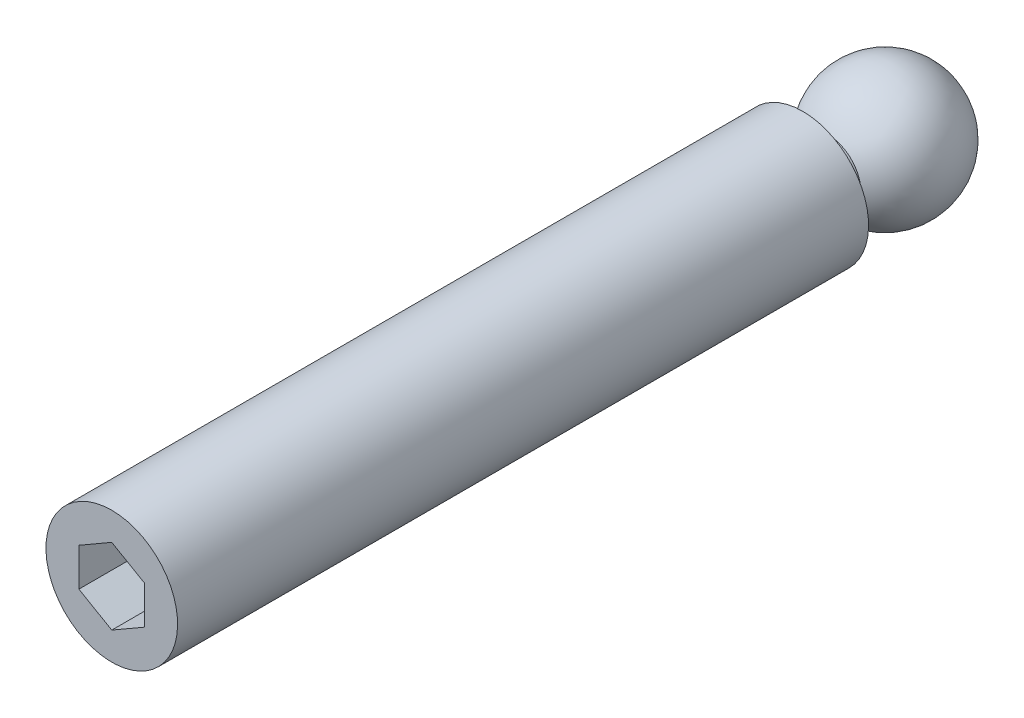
ISO-10303-21;
HEADER;
FILE_DESCRIPTION(('STEP AP214'),'2;1');
FILE_NAME('part.step','',(''),(''),'','','');
FILE_SCHEMA(('AUTOMOTIVE_DESIGN { 1 0 10303 214 1 1 1 1 }'));
ENDSEC;
DATA;
#1=APPLICATION_CONTEXT('core data for automotive mechanical design processes');
#2=APPLICATION_PROTOCOL_DEFINITION('international standard','automotive_design',2000,#1);
#3=PRODUCT_CONTEXT('',#1,'mechanical');
#4=PRODUCT('Part','Part','',(#3));
#5=PRODUCT_RELATED_PRODUCT_CATEGORY('part','',(#4));
#6=PRODUCT_DEFINITION_FORMATION('','',#4);
#7=PRODUCT_DEFINITION_CONTEXT('part definition',#1,'design');
#8=PRODUCT_DEFINITION('design','',#6,#7);
#9=PRODUCT_DEFINITION_SHAPE('','',#8);
#10=(LENGTH_UNIT() NAMED_UNIT(*) SI_UNIT(.MILLI.,.METRE.));
#11=(NAMED_UNIT(*) PLANE_ANGLE_UNIT() SI_UNIT($,.RADIAN.));
#12=(NAMED_UNIT(*) SI_UNIT($,.STERADIAN.) SOLID_ANGLE_UNIT());
#13=UNCERTAINTY_MEASURE_WITH_UNIT(LENGTH_MEASURE(1.E-05),#10,'distance_accuracy_value','');
#14=(GEOMETRIC_REPRESENTATION_CONTEXT(3) GLOBAL_UNCERTAINTY_ASSIGNED_CONTEXT((#13)) GLOBAL_UNIT_ASSIGNED_CONTEXT((#10,
#11,#12)) REPRESENTATION_CONTEXT('',''));
#15=CARTESIAN_POINT('',(0.,0.,0.));
#16=DIRECTION('',(0.,0.,1.));
#17=DIRECTION('',(1.,0.,0.));
#18=AXIS2_PLACEMENT_3D('',#15,#16,#17);
#19=CARTESIAN_POINT('',(0.,0.,4.));
#20=DIRECTION('',(0.,-1.,0.));
#21=DIRECTION('',(-1.,0.,0.));
#22=AXIS2_PLACEMENT_3D('',#19,#20,#21);
#23=SPHERICAL_SURFACE('',#22,4.);
#24=CARTESIAN_POINT('',(0.,0.,4.));
#25=DIRECTION('',(0.,0.,1.));
#26=DIRECTION('',(0.,1.,0.));
#27=AXIS2_PLACEMENT_3D('',#24,#25,#26);
#28=SPHERICAL_SURFACE('',#27,4.);
#29=CARTESIAN_POINT('',(0.,0.,7.46410161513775));
#30=DIRECTION('',(0.,0.,1.));
#31=DIRECTION('',(0.,1.,0.));
#32=AXIS2_PLACEMENT_3D('',#29,#30,#31);
#33=CIRCLE('',#32,2.);
#34=CARTESIAN_POINT('',(0.,2.,7.46410161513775));
#35=VERTEX_POINT('',#34);
#36=EDGE_CURVE('E17',#35,#35,#33,.T.);
#37=ORIENTED_EDGE('',*,*,#36,.F.);
#38=EDGE_LOOP('',(#37));
#39=FACE_BOUND('',#38,.T.);
#40=ADVANCED_FACE('F14',(#39),#28,.T.);
#41=CARTESIAN_POINT('',(0.,0.,30.));
#42=DIRECTION('',(0.,0.,1.));
#43=DIRECTION('',(0.,1.,0.));
#44=AXIS2_PLACEMENT_3D('',#41,#42,#43);
#45=CYLINDRICAL_SURFACE('',#44,2.);
#46=ORIENTED_EDGE('',*,*,#36,.T.);
#47=EDGE_LOOP('',(#46));
#48=FACE_BOUND('',#47,.T.);
#49=CARTESIAN_POINT('',(0.,0.,9.));
#50=DIRECTION('',(0.,0.,1.));
#51=DIRECTION('',(0.,1.,0.));
#52=AXIS2_PLACEMENT_3D('',#49,#50,#51);
#53=CIRCLE('',#52,2.);
#54=CARTESIAN_POINT('',(0.,2.,9.));
#55=VERTEX_POINT('',#54);
#56=EDGE_CURVE('E9',#55,#55,#53,.T.);
#57=ORIENTED_EDGE('',*,*,#56,.F.);
#58=EDGE_LOOP('',(#57));
#59=FACE_BOUND('',#58,.T.);
#60=ADVANCED_FACE('F127',(#48,#59),#45,.T.);
#61=CARTESIAN_POINT('',(0.,0.,9.));
#62=DIRECTION('',(0.,0.,1.));
#63=DIRECTION('',(1.,0.,0.));
#64=AXIS2_PLACEMENT_3D('',#61,#62,#63);
#65=CYLINDRICAL_SURFACE('',#64,4.);
#66=CARTESIAN_POINT('',(0.,0.,9.));
#67=DIRECTION('',(0.,0.,-1.));
#68=DIRECTION('',(-1.,0.,0.));
#69=AXIS2_PLACEMENT_3D('',#66,#67,#68);
#70=CIRCLE('',#69,4.);
#71=CARTESIAN_POINT('',(-4.,0.,9.));
#72=VERTEX_POINT('',#71);
#73=EDGE_CURVE('E106',#72,#72,#70,.T.);
#74=ORIENTED_EDGE('',*,*,#73,.F.);
#75=EDGE_LOOP('',(#74));
#76=FACE_BOUND('',#75,.T.);
#77=CARTESIAN_POINT('',(0.,0.,51.));
#78=DIRECTION('',(0.,0.,1.));
#79=DIRECTION('',(0.,1.,0.));
#80=AXIS2_PLACEMENT_3D('',#77,#78,#79);
#81=CIRCLE('',#80,4.);
#82=CARTESIAN_POINT('',(0.,4.,51.));
#83=VERTEX_POINT('',#82);
#84=EDGE_CURVE('E248',#83,#83,#81,.T.);
#85=ORIENTED_EDGE('',*,*,#84,.F.);
#86=EDGE_LOOP('',(#85));
#87=FACE_BOUND('',#86,.T.);
#88=ADVANCED_FACE('F131',(#76,#87),#65,.T.);
#89=CARTESIAN_POINT('',(0.,0.,9.));
#90=DIRECTION('',(0.,0.,-1.));
#91=DIRECTION('',(-1.,0.,0.));
#92=AXIS2_PLACEMENT_3D('',#89,#90,#91);
#93=PLANE('',#92);
#94=ORIENTED_EDGE('',*,*,#56,.T.);
#95=EDGE_LOOP('',(#94));
#96=FACE_BOUND('',#95,.T.);
#97=ORIENTED_EDGE('',*,*,#73,.T.);
#98=EDGE_LOOP('',(#97));
#99=FACE_BOUND('',#98,.T.);
#100=ADVANCED_FACE('F138',(#96,#99),#93,.T.);
#101=CARTESIAN_POINT('',(0.,2.30940107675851,46.));
#102=DIRECTION('',(0.,0.,1.));
#103=DIRECTION('',(1.,0.,0.));
#104=AXIS2_PLACEMENT_3D('',#101,#102,#103);
#105=PLANE('',#104);
#106=DIRECTION('',(-0.866025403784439,0.5,0.));
#107=VECTOR('',#106,1.);
#108=CARTESIAN_POINT('',(2.,1.15470053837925,46.));
#109=LINE('',#108,#107);
#110=CARTESIAN_POINT('',(2.,1.15470053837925,46.));
#111=VERTEX_POINT('',#110);
#112=CARTESIAN_POINT('',(0.,2.30940107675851,46.));
#113=VERTEX_POINT('',#112);
#114=EDGE_CURVE('E97',#111,#113,#109,.T.);
#115=ORIENTED_EDGE('',*,*,#114,.T.);
#116=DIRECTION('',(-0.866025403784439,-0.5,0.));
#117=VECTOR('',#116,1.);
#118=CARTESIAN_POINT('',(0.,2.30940107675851,46.));
#119=LINE('',#118,#117);
#120=CARTESIAN_POINT('',(-2.,1.15470053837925,46.));
#121=VERTEX_POINT('',#120);
#122=EDGE_CURVE('E116',#113,#121,#119,.T.);
#123=ORIENTED_EDGE('',*,*,#122,.T.);
#124=DIRECTION('',(0.,-1.,0.));
#125=VECTOR('',#124,1.);
#126=CARTESIAN_POINT('',(-2.,1.15470053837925,46.));
#127=LINE('',#126,#125);
#128=CARTESIAN_POINT('',(-2.,-1.15470053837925,46.));
#129=VERTEX_POINT('',#128);
#130=EDGE_CURVE('E113',#121,#129,#127,.T.);
#131=ORIENTED_EDGE('',*,*,#130,.T.);
#132=DIRECTION('',(0.866025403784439,-0.5,0.));
#133=VECTOR('',#132,1.);
#134=CARTESIAN_POINT('',(-2.,-1.15470053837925,46.));
#135=LINE('',#134,#133);
#136=CARTESIAN_POINT('',(0.,-2.30940107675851,46.));
#137=VERTEX_POINT('',#136);
#138=EDGE_CURVE('E111',#129,#137,#135,.T.);
#139=ORIENTED_EDGE('',*,*,#138,.T.);
#140=DIRECTION('',(0.866025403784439,0.5,0.));
#141=VECTOR('',#140,1.);
#142=CARTESIAN_POINT('',(0.,-2.30940107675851,46.));
#143=LINE('',#142,#141);
#144=CARTESIAN_POINT('',(2.,-1.15470053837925,46.));
#145=VERTEX_POINT('',#144);
#146=EDGE_CURVE('E78',#137,#145,#143,.T.);
#147=ORIENTED_EDGE('',*,*,#146,.T.);
#148=DIRECTION('',(0.,1.,0.));
#149=VECTOR('',#148,1.);
#150=CARTESIAN_POINT('',(2.,-1.15470053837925,46.));
#151=LINE('',#150,#149);
#152=EDGE_CURVE('E107',#145,#111,#151,.T.);
#153=ORIENTED_EDGE('',*,*,#152,.T.);
#154=EDGE_LOOP('',(#115,#123,#131,#139,#147,#153));
#155=FACE_BOUND('',#154,.T.);
#156=ADVANCED_FACE('F145',(#155),#105,.T.);
#157=CARTESIAN_POINT('',(0.,2.30940107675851,46.));
#158=DIRECTION('',(-0.5,0.866025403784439,0.));
#159=DIRECTION('',(-0.866025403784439,-0.5,0.));
#160=AXIS2_PLACEMENT_3D('',#157,#158,#159);
#161=PLANE('',#160);
#162=DIRECTION('',(-0.866025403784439,-0.5,0.));
#163=VECTOR('',#162,1.);
#164=CARTESIAN_POINT('',(0.,2.30940107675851,51.));
#165=LINE('',#164,#163);
#166=CARTESIAN_POINT('',(0.,2.30940107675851,51.));
#167=VERTEX_POINT('',#166);
#168=CARTESIAN_POINT('',(-2.,1.15470053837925,51.));
#169=VERTEX_POINT('',#168);
#170=EDGE_CURVE('E102',#167,#169,#165,.T.);
#171=ORIENTED_EDGE('',*,*,#170,.T.);
#172=DIRECTION('',(0.,0.,1.));
#173=VECTOR('',#172,1.);
#174=CARTESIAN_POINT('',(-2.,1.15470053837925,46.));
#175=LINE('',#174,#173);
#176=EDGE_CURVE('E30',#121,#169,#175,.T.);
#177=ORIENTED_EDGE('',*,*,#176,.F.);
#178=ORIENTED_EDGE('',*,*,#122,.F.);
#179=DIRECTION('',(0.,0.,1.));
#180=VECTOR('',#179,1.);
#181=CARTESIAN_POINT('',(0.,2.30940107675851,46.));
#182=LINE('',#181,#180);
#183=EDGE_CURVE('E58',#113,#167,#182,.T.);
#184=ORIENTED_EDGE('',*,*,#183,.T.);
#185=EDGE_LOOP('',(#171,#177,#178,#184));
#186=FACE_BOUND('',#185,.T.);
#187=ADVANCED_FACE('F152',(#186),#161,.F.);
#188=CARTESIAN_POINT('',(-2.,1.15470053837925,46.));
#189=DIRECTION('',(-1.,0.,0.));
#190=DIRECTION('',(0.,-1.,0.));
#191=AXIS2_PLACEMENT_3D('',#188,#189,#190);
#192=PLANE('',#191);
#193=DIRECTION('',(0.,-1.,0.));
#194=VECTOR('',#193,1.);
#195=CARTESIAN_POINT('',(-2.,1.15470053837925,51.));
#196=LINE('',#195,#194);
#197=CARTESIAN_POINT('',(-2.,-1.15470053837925,51.));
#198=VERTEX_POINT('',#197);
#199=EDGE_CURVE('E90',#169,#198,#196,.T.);
#200=ORIENTED_EDGE('',*,*,#199,.T.);
#201=DIRECTION('',(0.,0.,1.));
#202=VECTOR('',#201,1.);
#203=CARTESIAN_POINT('',(-2.,-1.15470053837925,46.));
#204=LINE('',#203,#202);
#205=EDGE_CURVE('E82',#129,#198,#204,.T.);
#206=ORIENTED_EDGE('',*,*,#205,.F.);
#207=ORIENTED_EDGE('',*,*,#130,.F.);
#208=ORIENTED_EDGE('',*,*,#176,.T.);
#209=EDGE_LOOP('',(#200,#206,#207,#208));
#210=FACE_BOUND('',#209,.T.);
#211=ADVANCED_FACE('F163',(#210),#192,.F.);
#212=CARTESIAN_POINT('',(-2.,-1.15470053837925,46.));
#213=DIRECTION('',(-0.5,-0.866025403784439,0.));
#214=DIRECTION('',(0.866025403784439,-0.5,0.));
#215=AXIS2_PLACEMENT_3D('',#212,#213,#214);
#216=PLANE('',#215);
#217=DIRECTION('',(0.866025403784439,-0.5,0.));
#218=VECTOR('',#217,1.);
#219=CARTESIAN_POINT('',(-2.,-1.15470053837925,51.));
#220=LINE('',#219,#218);
#221=CARTESIAN_POINT('',(0.,-2.30940107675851,51.));
#222=VERTEX_POINT('',#221);
#223=EDGE_CURVE('E86',#198,#222,#220,.T.);
#224=ORIENTED_EDGE('',*,*,#223,.T.);
#225=DIRECTION('',(0.,0.,1.));
#226=VECTOR('',#225,1.);
#227=CARTESIAN_POINT('',(0.,-2.30940107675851,46.));
#228=LINE('',#227,#226);
#229=EDGE_CURVE('E71',#137,#222,#228,.T.);
#230=ORIENTED_EDGE('',*,*,#229,.F.);
#231=ORIENTED_EDGE('',*,*,#138,.F.);
#232=ORIENTED_EDGE('',*,*,#205,.T.);
#233=EDGE_LOOP('',(#224,#230,#231,#232));
#234=FACE_BOUND('',#233,.T.);
#235=ADVANCED_FACE('F87',(#234),#216,.F.);
#236=CARTESIAN_POINT('',(0.,-2.30940107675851,46.));
#237=DIRECTION('',(0.5,-0.866025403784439,0.));
#238=DIRECTION('',(0.866025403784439,0.5,0.));
#239=AXIS2_PLACEMENT_3D('',#236,#237,#238);
#240=PLANE('',#239);
#241=DIRECTION('',(0.866025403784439,0.5,0.));
#242=VECTOR('',#241,1.);
#243=CARTESIAN_POINT('',(0.,-2.30940107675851,51.));
#244=LINE('',#243,#242);
#245=CARTESIAN_POINT('',(2.,-1.15470053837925,51.));
#246=VERTEX_POINT('',#245);
#247=EDGE_CURVE('E75',#222,#246,#244,.T.);
#248=ORIENTED_EDGE('',*,*,#247,.T.);
#249=DIRECTION('',(0.,0.,1.));
#250=VECTOR('',#249,1.);
#251=CARTESIAN_POINT('',(2.,-1.15470053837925,46.));
#252=LINE('',#251,#250);
#253=EDGE_CURVE('E83',#145,#246,#252,.T.);
#254=ORIENTED_EDGE('',*,*,#253,.F.);
#255=ORIENTED_EDGE('',*,*,#146,.F.);
#256=ORIENTED_EDGE('',*,*,#229,.T.);
#257=EDGE_LOOP('',(#248,#254,#255,#256));
#258=FACE_BOUND('',#257,.T.);
#259=ADVANCED_FACE('F73',(#258),#240,.F.);
#260=CARTESIAN_POINT('',(2.,-1.15470053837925,46.));
#261=DIRECTION('',(1.,0.,0.));
#262=DIRECTION('',(0.,0.,-1.));
#263=AXIS2_PLACEMENT_3D('',#260,#261,#262);
#264=PLANE('',#263);
#265=DIRECTION('',(0.,1.,0.));
#266=VECTOR('',#265,1.);
#267=CARTESIAN_POINT('',(2.,-1.15470053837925,51.));
#268=LINE('',#267,#266);
#269=CARTESIAN_POINT('',(2.,1.15470053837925,51.));
#270=VERTEX_POINT('',#269);
#271=EDGE_CURVE('E95',#246,#270,#268,.T.);
#272=ORIENTED_EDGE('',*,*,#271,.T.);
#273=DIRECTION('',(0.,0.,1.));
#274=VECTOR('',#273,1.);
#275=CARTESIAN_POINT('',(2.,1.15470053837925,46.));
#276=LINE('',#275,#274);
#277=EDGE_CURVE('E62',#111,#270,#276,.T.);
#278=ORIENTED_EDGE('',*,*,#277,.F.);
#279=ORIENTED_EDGE('',*,*,#152,.F.);
#280=ORIENTED_EDGE('',*,*,#253,.T.);
#281=EDGE_LOOP('',(#272,#278,#279,#280));
#282=FACE_BOUND('',#281,.T.);
#283=ADVANCED_FACE('F154',(#282),#264,.F.);
#284=CARTESIAN_POINT('',(2.,1.15470053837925,46.));
#285=DIRECTION('',(0.5,0.866025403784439,0.));
#286=DIRECTION('',(-0.866025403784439,0.5,0.));
#287=AXIS2_PLACEMENT_3D('',#284,#285,#286);
#288=PLANE('',#287);
#289=DIRECTION('',(-0.866025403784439,0.5,0.));
#290=VECTOR('',#289,1.);
#291=CARTESIAN_POINT('',(2.,1.15470053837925,51.));
#292=LINE('',#291,#290);
#293=EDGE_CURVE('E104',#270,#167,#292,.T.);
#294=ORIENTED_EDGE('',*,*,#293,.T.);
#295=ORIENTED_EDGE('',*,*,#183,.F.);
#296=ORIENTED_EDGE('',*,*,#114,.F.);
#297=ORIENTED_EDGE('',*,*,#277,.T.);
#298=EDGE_LOOP('',(#294,#295,#296,#297));
#299=FACE_BOUND('',#298,.T.);
#300=ADVANCED_FACE('F157',(#299),#288,.F.);
#301=CARTESIAN_POINT('',(0.,0.,51.));
#302=DIRECTION('',(0.,0.,1.));
#303=DIRECTION('',(0.,1.,0.));
#304=AXIS2_PLACEMENT_3D('',#301,#302,#303);
#305=PLANE('',#304);
#306=ORIENTED_EDGE('',*,*,#293,.F.);
#307=ORIENTED_EDGE('',*,*,#271,.F.);
#308=ORIENTED_EDGE('',*,*,#247,.F.);
#309=ORIENTED_EDGE('',*,*,#223,.F.);
#310=ORIENTED_EDGE('',*,*,#199,.F.);
#311=ORIENTED_EDGE('',*,*,#170,.F.);
#312=EDGE_LOOP('',(#306,#307,#308,#309,#310,#311));
#313=FACE_BOUND('',#312,.T.);
#314=ORIENTED_EDGE('',*,*,#84,.T.);
#315=EDGE_LOOP('',(#314));
#316=FACE_BOUND('',#315,.T.);
#317=ADVANCED_FACE('F93',(#313,#316),#305,.T.);
#318=CLOSED_SHELL('',(#40,#60,#88,#100,#156,#187,#211,#235,#259,#283,#300,#317));
#319=MANIFOLD_SOLID_BREP('B1',#318);
#320=ADVANCED_BREP_SHAPE_REPRESENTATION('',(#18,#319),#14);
#321=SHAPE_DEFINITION_REPRESENTATION(#9,#320);
ENDSEC;
END-ISO-10303-21;
